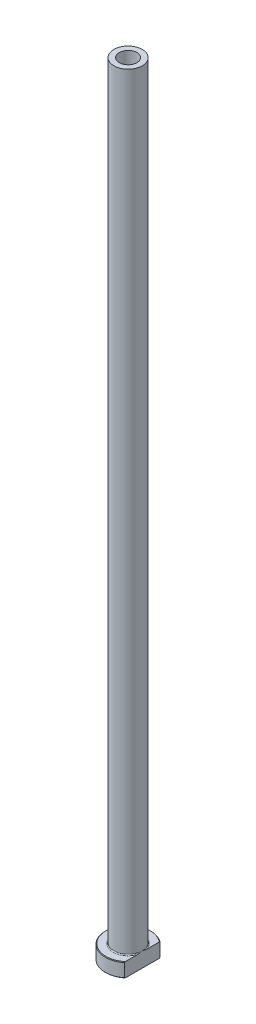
ISO-10303-21;
HEADER;
FILE_DESCRIPTION(('STEP AP214'),'2;1');
FILE_NAME('part.step','',(''),(''),'','','');
FILE_SCHEMA(('AUTOMOTIVE_DESIGN { 1 0 10303 214 1 1 1 1 }'));
ENDSEC;
DATA;
#1=APPLICATION_CONTEXT('core data for automotive mechanical design processes');
#2=APPLICATION_PROTOCOL_DEFINITION('international standard','automotive_design',2000,#1);
#3=PRODUCT_CONTEXT('',#1,'mechanical');
#4=PRODUCT('Part','Part','',(#3));
#5=PRODUCT_RELATED_PRODUCT_CATEGORY('part','',(#4));
#6=PRODUCT_DEFINITION_FORMATION('','',#4);
#7=PRODUCT_DEFINITION_CONTEXT('part definition',#1,'design');
#8=PRODUCT_DEFINITION('design','',#6,#7);
#9=PRODUCT_DEFINITION_SHAPE('','',#8);
#10=(LENGTH_UNIT() NAMED_UNIT(*) SI_UNIT(.MILLI.,.METRE.));
#11=(NAMED_UNIT(*) PLANE_ANGLE_UNIT() SI_UNIT($,.RADIAN.));
#12=(NAMED_UNIT(*) SI_UNIT($,.STERADIAN.) SOLID_ANGLE_UNIT());
#13=UNCERTAINTY_MEASURE_WITH_UNIT(LENGTH_MEASURE(1.E-05),#10,'distance_accuracy_value','');
#14=(GEOMETRIC_REPRESENTATION_CONTEXT(3) GLOBAL_UNCERTAINTY_ASSIGNED_CONTEXT((#13)) GLOBAL_UNIT_ASSIGNED_CONTEXT((#10,
#11,#12)) REPRESENTATION_CONTEXT('',''));
#15=CARTESIAN_POINT('',(0.,0.,0.));
#16=DIRECTION('',(0.,0.,1.));
#17=DIRECTION('',(1.,0.,0.));
#18=AXIS2_PLACEMENT_3D('',#15,#16,#17);
#19=CARTESIAN_POINT('',(0.,92.1876809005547,0.));
#20=DIRECTION('',(0.,1.,0.));
#21=DIRECTION('',(0.,0.,1.));
#22=AXIS2_PLACEMENT_3D('',#19,#20,#21);
#23=CYLINDRICAL_SURFACE('',#22,3.10000000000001);
#24=CARTESIAN_POINT('',(0.,275.,0.));
#25=DIRECTION('',(0.,1.,0.));
#26=DIRECTION('',(0.,0.,1.));
#27=AXIS2_PLACEMENT_3D('',#24,#25,#26);
#28=CIRCLE('',#27,3.10000000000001);
#29=CARTESIAN_POINT('',(0.,275.,3.10000000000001));
#30=VERTEX_POINT('',#29);
#31=EDGE_CURVE('E167',#30,#30,#28,.T.);
#32=ORIENTED_EDGE('',*,*,#31,.T.);
#33=EDGE_LOOP('',(#32));
#34=FACE_BOUND('',#33,.T.);
#35=CARTESIAN_POINT('',(0.,230.,0.));
#36=DIRECTION('',(0.,1.,0.));
#37=DIRECTION('',(0.,0.,1.));
#38=AXIS2_PLACEMENT_3D('',#35,#36,#37);
#39=CIRCLE('',#38,3.10000000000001);
#40=CARTESIAN_POINT('',(0.,230.,3.10000000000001));
#41=VERTEX_POINT('',#40);
#42=EDGE_CURVE('E170',#41,#41,#39,.T.);
#43=ORIENTED_EDGE('',*,*,#42,.F.);
#44=EDGE_LOOP('',(#43));
#45=FACE_BOUND('',#44,.T.);
#46=ADVANCED_FACE('F32',(#34,#45),#23,.F.);
#47=CARTESIAN_POINT('',(-3.10000000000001,275.,0.));
#48=DIRECTION('',(0.,1.,0.));
#49=DIRECTION('',(0.,0.,1.));
#50=AXIS2_PLACEMENT_3D('',#47,#48,#49);
#51=PLANE('',#50);
#52=CARTESIAN_POINT('',(0.,275.,0.));
#53=DIRECTION('',(0.,1.,0.));
#54=DIRECTION('',(0.,0.,1.));
#55=AXIS2_PLACEMENT_3D('',#52,#53,#54);
#56=CIRCLE('',#55,5.00000000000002);
#57=CARTESIAN_POINT('',(0.,275.,5.00000000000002));
#58=VERTEX_POINT('',#57);
#59=EDGE_CURVE('E174',#58,#58,#56,.T.);
#60=ORIENTED_EDGE('',*,*,#59,.T.);
#61=EDGE_LOOP('',(#60));
#62=FACE_BOUND('',#61,.T.);
#63=ORIENTED_EDGE('',*,*,#31,.F.);
#64=EDGE_LOOP('',(#63));
#65=FACE_BOUND('',#64,.T.);
#66=ADVANCED_FACE('F157',(#62,#65),#51,.T.);
#67=CARTESIAN_POINT('',(0.,92.1876809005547,0.));
#68=DIRECTION('',(0.,1.,0.));
#69=DIRECTION('',(0.,0.,1.));
#70=AXIS2_PLACEMENT_3D('',#67,#68,#69);
#71=CYLINDRICAL_SURFACE('',#70,5.00000000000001);
#72=CARTESIAN_POINT('',(0.,5.3,0.));
#73=DIRECTION('',(0.,1.,0.));
#74=DIRECTION('',(0.,0.,1.));
#75=AXIS2_PLACEMENT_3D('',#72,#73,#74);
#76=CIRCLE('',#75,5.00000000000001);
#77=CARTESIAN_POINT('',(5.,5.3,0.));
#78=VERTEX_POINT('',#77);
#79=EDGE_CURVE('E180',#78,#78,#76,.T.);
#80=ORIENTED_EDGE('',*,*,#79,.T.);
#81=EDGE_LOOP('',(#80));
#82=FACE_BOUND('',#81,.T.);
#83=ORIENTED_EDGE('',*,*,#59,.F.);
#84=EDGE_LOOP('',(#83));
#85=FACE_BOUND('',#84,.T.);
#86=ADVANCED_FACE('F162',(#82,#85),#71,.T.);
#87=CARTESIAN_POINT('',(-4.99999999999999,5.,0.));
#88=DIRECTION('',(0.,1.,0.));
#89=DIRECTION('',(0.,0.,1.));
#90=AXIS2_PLACEMENT_3D('',#87,#88,#89);
#91=PLANE('',#90);
#92=DIRECTION('',(0.,0.,1.));
#93=VECTOR('',#92,1.);
#94=CARTESIAN_POINT('',(5.,5.,0.));
#95=LINE('',#94,#93);
#96=CARTESIAN_POINT('',(5.,5.,-5.98665181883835));
#97=VERTEX_POINT('',#96);
#98=CARTESIAN_POINT('',(5.,5.,-1.75783958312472));
#99=VERTEX_POINT('',#98);
#100=EDGE_CURVE('E54',#97,#99,#95,.T.);
#101=ORIENTED_EDGE('',*,*,#100,.F.);
#102=CARTESIAN_POINT('',(0.,5.,0.));
#103=DIRECTION('',(0.,1.,0.));
#104=DIRECTION('',(0.,0.,1.));
#105=AXIS2_PLACEMENT_3D('',#102,#103,#104);
#106=CIRCLE('',#105,7.80000000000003);
#107=CARTESIAN_POINT('',(4.99999999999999,5.,5.98665181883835));
#108=VERTEX_POINT('',#107);
#109=EDGE_CURVE('E186',#97,#108,#106,.T.);
#110=ORIENTED_EDGE('',*,*,#109,.T.);
#111=CARTESIAN_POINT('',(5.,5.,1.75783958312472));
#112=VERTEX_POINT('',#111);
#113=EDGE_CURVE('E134',#112,#108,#95,.T.);
#114=ORIENTED_EDGE('',*,*,#113,.F.);
#115=CARTESIAN_POINT('',(0.,5.,0.));
#116=DIRECTION('',(0.,1.,0.));
#117=DIRECTION('',(0.,0.,1.));
#118=AXIS2_PLACEMENT_3D('',#115,#116,#117);
#119=CIRCLE('',#118,5.30000000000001);
#120=EDGE_CURVE('E183',#112,#99,#119,.F.);
#121=ORIENTED_EDGE('',*,*,#120,.T.);
#122=EDGE_LOOP('',(#101,#110,#114,#121));
#123=FACE_BOUND('',#122,.T.);
#124=ADVANCED_FACE('F197',(#123),#91,.T.);
#125=CARTESIAN_POINT('',(0.,92.1876809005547,0.));
#126=DIRECTION('',(0.,1.,0.));
#127=DIRECTION('',(0.,0.,1.));
#128=AXIS2_PLACEMENT_3D('',#125,#126,#127);
#129=CYLINDRICAL_SURFACE('',#128,7.99999999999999);
#130=DIRECTION('',(0.,-1.,0.));
#131=VECTOR('',#130,1.);
#132=CARTESIAN_POINT('',(4.99999999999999,275.,6.24499799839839));
#133=LINE('',#132,#131);
#134=CARTESIAN_POINT('',(4.99999999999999,4.80000000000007,6.24499799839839));
#135=VERTEX_POINT('',#134);
#136=CARTESIAN_POINT('',(4.99999999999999,0.200000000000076,6.24499799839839));
#137=VERTEX_POINT('',#136);
#138=EDGE_CURVE('E82',#135,#137,#133,.T.);
#139=ORIENTED_EDGE('',*,*,#138,.F.);
#140=CARTESIAN_POINT('',(0.,4.80000000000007,0.));
#141=DIRECTION('',(0.,1.,0.));
#142=DIRECTION('',(0.,0.,1.));
#143=AXIS2_PLACEMENT_3D('',#140,#141,#142);
#144=CIRCLE('',#143,7.99999999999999);
#145=CARTESIAN_POINT('',(5.,4.80000000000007,-6.24499799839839));
#146=VERTEX_POINT('',#145);
#147=EDGE_CURVE('E95',#135,#146,#144,.F.);
#148=ORIENTED_EDGE('',*,*,#147,.T.);
#149=DIRECTION('',(0.,-1.,0.));
#150=VECTOR('',#149,1.);
#151=CARTESIAN_POINT('',(5.,275.,-6.24499799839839));
#152=LINE('',#151,#150);
#153=CARTESIAN_POINT('',(5.,0.200000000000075,-6.24499799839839));
#154=VERTEX_POINT('',#153);
#155=EDGE_CURVE('E192',#146,#154,#152,.T.);
#156=ORIENTED_EDGE('',*,*,#155,.T.);
#157=CARTESIAN_POINT('',(0.,0.200000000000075,0.));
#158=DIRECTION('',(0.,-1.,0.));
#159=DIRECTION('',(0.,0.,-1.));
#160=AXIS2_PLACEMENT_3D('',#157,#158,#159);
#161=CIRCLE('',#160,7.99999999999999);
#162=EDGE_CURVE('E98',#154,#137,#161,.F.);
#163=ORIENTED_EDGE('',*,*,#162,.T.);
#164=EDGE_LOOP('',(#139,#148,#156,#163));
#165=FACE_BOUND('',#164,.T.);
#166=ADVANCED_FACE('F190',(#165),#129,.T.);
#167=CARTESIAN_POINT('',(-7.99999999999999,0.,0.));
#168=DIRECTION('',(0.,-1.,0.));
#169=DIRECTION('',(0.,0.,-1.));
#170=AXIS2_PLACEMENT_3D('',#167,#168,#169);
#171=PLANE('',#170);
#172=CARTESIAN_POINT('',(0.,0.,0.));
#173=DIRECTION('',(0.,-1.,0.));
#174=DIRECTION('',(0.,0.,-1.));
#175=AXIS2_PLACEMENT_3D('',#172,#173,#174);
#176=CIRCLE('',#175,3.84999999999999);
#177=CARTESIAN_POINT('',(0.,0.,-3.84999999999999));
#178=VERTEX_POINT('',#177);
#179=EDGE_CURVE('E40',#178,#178,#176,.F.);
#180=ORIENTED_EDGE('',*,*,#179,.T.);
#181=EDGE_LOOP('',(#180));
#182=FACE_BOUND('',#181,.T.);
#183=DIRECTION('',(0.,0.,-1.));
#184=VECTOR('',#183,1.);
#185=CARTESIAN_POINT('',(4.99999999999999,0.,6.24499799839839));
#186=LINE('',#185,#184);
#187=CARTESIAN_POINT('',(4.99999999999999,0.,5.98665181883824));
#188=VERTEX_POINT('',#187);
#189=CARTESIAN_POINT('',(5.,0.,-5.98665181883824));
#190=VERTEX_POINT('',#189);
#191=EDGE_CURVE('E47',#188,#190,#186,.T.);
#192=ORIENTED_EDGE('',*,*,#191,.F.);
#193=CARTESIAN_POINT('',(0.,0.,0.));
#194=DIRECTION('',(0.,-1.,0.));
#195=DIRECTION('',(0.,0.,-1.));
#196=AXIS2_PLACEMENT_3D('',#193,#194,#195);
#197=CIRCLE('',#196,7.79999999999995);
#198=EDGE_CURVE('E92',#188,#190,#197,.T.);
#199=ORIENTED_EDGE('',*,*,#198,.T.);
#200=EDGE_LOOP('',(#192,#199));
#201=FACE_BOUND('',#200,.T.);
#202=ADVANCED_FACE('F91',(#182,#201),#171,.T.);
#203=CARTESIAN_POINT('',(0.,92.1876809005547,0.));
#204=DIRECTION('',(0.,1.,0.));
#205=DIRECTION('',(0.,0.,1.));
#206=AXIS2_PLACEMENT_3D('',#203,#204,#205);
#207=CYLINDRICAL_SURFACE('',#206,3.35);
#208=CARTESIAN_POINT('',(0.,0.5,0.));
#209=DIRECTION('',(0.,-1.,0.));
#210=DIRECTION('',(0.,0.,-1.));
#211=AXIS2_PLACEMENT_3D('',#208,#209,#210);
#212=CIRCLE('',#211,3.35);
#213=CARTESIAN_POINT('',(0.,0.5,-3.35));
#214=VERTEX_POINT('',#213);
#215=EDGE_CURVE('E11',#214,#214,#212,.T.);
#216=ORIENTED_EDGE('',*,*,#215,.T.);
#217=EDGE_LOOP('',(#216));
#218=FACE_BOUND('',#217,.T.);
#219=CARTESIAN_POINT('',(0.,218.,0.));
#220=DIRECTION('',(0.,1.,0.));
#221=DIRECTION('',(0.,0.,1.));
#222=AXIS2_PLACEMENT_3D('',#219,#220,#221);
#223=CIRCLE('',#222,3.35000000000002);
#224=CARTESIAN_POINT('',(0.,218.,3.35000000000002));
#225=VERTEX_POINT('',#224);
#226=EDGE_CURVE('E172',#225,#225,#223,.T.);
#227=ORIENTED_EDGE('',*,*,#226,.T.);
#228=EDGE_LOOP('',(#227));
#229=FACE_BOUND('',#228,.T.);
#230=ADVANCED_FACE('F215',(#218,#229),#207,.F.);
#231=CARTESIAN_POINT('',(0.,218.,0.));
#232=DIRECTION('',(0.,-1.,0.));
#233=DIRECTION('',(0.,0.,-1.));
#234=AXIS2_PLACEMENT_3D('',#231,#232,#233);
#235=CONICAL_SURFACE('',#234,3.35000000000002,0.0208303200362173);
#236=ORIENTED_EDGE('',*,*,#42,.T.);
#237=EDGE_LOOP('',(#236));
#238=FACE_BOUND('',#237,.T.);
#239=ORIENTED_EDGE('',*,*,#226,.F.);
#240=EDGE_LOOP('',(#239));
#241=FACE_BOUND('',#240,.T.);
#242=ADVANCED_FACE('F111',(#238,#241),#235,.F.);
#243=CARTESIAN_POINT('',(0.,5.3,0.));
#244=DIRECTION('',(0.,1.,0.));
#245=DIRECTION('',(0.,0.,1.));
#246=AXIS2_PLACEMENT_3D('',#243,#244,#245);
#247=TOROIDAL_SURFACE('',#246,5.30000000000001,0.3);
#248=ORIENTED_EDGE('',*,*,#120,.F.);
#249=CARTESIAN_POINT('',(5.,5.3,0.));
#250=CARTESIAN_POINT('',(5.,5.30000062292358,-1.31469178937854E-10));
#251=CARTESIAN_POINT('',(5.,5.30000124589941,2.52759407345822E-07));
#252=CARTESIAN_POINT('',(5.,5.30000240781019,9.47164733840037E-07));
#253=CARTESIAN_POINT('',(5.,5.30000293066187,1.40594081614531E-06));
#254=CARTESIAN_POINT('',(5.,5.30000402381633,2.50637668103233E-06));
#255=CARTESIAN_POINT('',(5.,5.30000457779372,3.16588983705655E-06));
#256=CARTESIAN_POINT('',(5.,5.30000556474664,4.52860049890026E-06));
#257=CARTESIAN_POINT('',(5.,5.30000600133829,5.22939526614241E-06));
#258=CARTESIAN_POINT('',(5.,5.30000763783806,7.96122117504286E-06));
#259=CARTESIAN_POINT('',(5.,5.30000875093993,1.00477426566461E-05));
#260=CARTESIAN_POINT('',(5.,5.30001056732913,1.41660893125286E-05));
#261=CARTESIAN_POINT('',(5.,5.3000112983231,1.61861800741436E-05));
#262=CARTESIAN_POINT('',(5.,5.30001439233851,2.47865769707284E-05));
#263=CARTESIAN_POINT('',(5.,5.30001672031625,3.13830323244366E-05));
#264=CARTESIAN_POINT('',(5.,5.3000201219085,4.38084266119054E-05));
#265=CARTESIAN_POINT('',(5.,5.30002133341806,4.95992779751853E-05));
#266=CARTESIAN_POINT('',(4.99999999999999,5.30003020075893,9.27862676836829E-05));
#267=CARTESIAN_POINT('',(5.,5.30003696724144,0.000130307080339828));
#268=CARTESIAN_POINT('',(5.,5.30006659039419,0.000278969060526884));
#269=CARTESIAN_POINT('',(5.,5.30009481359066,0.00038902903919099));
#270=CARTESIAN_POINT('',(4.99999999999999,5.30020506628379,0.000826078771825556));
#271=CARTESIAN_POINT('',(5.,5.30028365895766,0.00115365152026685));
#272=CARTESIAN_POINT('',(5.,5.30059919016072,0.00245925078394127));
#273=CARTESIAN_POINT('',(5.,5.30084048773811,0.00343651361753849));
#274=CARTESIAN_POINT('',(4.99999999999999,5.30184626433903,0.00752058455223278));
#275=CARTESIAN_POINT('',(4.99999999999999,5.30260525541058,0.0106283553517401));
#276=CARTESIAN_POINT('',(5.,5.30996461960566,0.0407482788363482));
#277=CARTESIAN_POINT('',(5.,5.3165898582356,0.0677561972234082));
#278=CARTESIAN_POINT('',(4.99999999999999,5.32953319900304,0.120688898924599));
#279=CARTESIAN_POINT('',(4.99999999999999,5.33585289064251,0.146613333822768));
#280=CARTESIAN_POINT('',(5.,5.34926050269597,0.20179565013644));
#281=CARTESIAN_POINT('',(5.,5.35634306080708,0.231054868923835));
#282=CARTESIAN_POINT('',(5.,5.3705025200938,0.289917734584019));
#283=CARTESIAN_POINT('',(5.,5.37757848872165,0.319521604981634));
#284=CARTESIAN_POINT('',(5.,5.3945260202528,0.391032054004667));
#285=CARTESIAN_POINT('',(5.,5.4043407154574,0.432952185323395));
#286=CARTESIAN_POINT('',(5.,5.42340141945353,0.515763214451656));
#287=CARTESIAN_POINT('',(5.,5.43265559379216,0.556652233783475));
#288=CARTESIAN_POINT('',(5.,5.4571055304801,0.66707517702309));
#289=CARTESIAN_POINT('',(5.,5.47194176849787,0.736689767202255));
#290=CARTESIAN_POINT('',(5.,5.50018229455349,0.876836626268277));
#291=CARTESIAN_POINT('',(5.,5.51357312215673,0.947371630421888));
#292=CARTESIAN_POINT('',(5.,5.53930921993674,1.09497328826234));
#293=CARTESIAN_POINT('',(5.,5.55146217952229,1.17207432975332));
#294=CARTESIAN_POINT('',(5.,5.57239669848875,1.32672649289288));
#295=CARTESIAN_POINT('',(5.,5.58117877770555,1.40427754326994));
#296=CARTESIAN_POINT('',(5.,5.59499725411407,1.56873827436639));
#297=CARTESIAN_POINT('',(5.,5.59948802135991,1.65570044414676));
#298=CARTESIAN_POINT('',(5.,5.60018885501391,1.78535304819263));
#299=CARTESIAN_POINT('',(5.,5.59945214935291,1.8280257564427));
#300=CARTESIAN_POINT('',(5.,5.59559364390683,1.91325081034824));
#301=CARTESIAN_POINT('',(5.,5.59247319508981,1.95580321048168));
#302=CARTESIAN_POINT('',(5.,5.58383242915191,2.03512365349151));
#303=CARTESIAN_POINT('',(5.,5.5786738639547,2.07192937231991));
#304=CARTESIAN_POINT('',(5.,5.56543793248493,2.1452675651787));
#305=CARTESIAN_POINT('',(5.,5.55734203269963,2.18179676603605));
#306=CARTESIAN_POINT('',(5.,5.53718005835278,2.25427226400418));
#307=CARTESIAN_POINT('',(5.,5.52507057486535,2.29020746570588));
#308=CARTESIAN_POINT('',(5.,5.50270928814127,2.34223029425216));
#309=CARTESIAN_POINT('',(5.,5.49457811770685,2.3592231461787));
#310=CARTESIAN_POINT('',(5.,5.47657809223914,2.39224900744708));
#311=CARTESIAN_POINT('',(5.,5.4667128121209,2.40828390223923));
#312=CARTESIAN_POINT('',(5.,5.44695893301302,2.43579467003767));
#313=CARTESIAN_POINT('',(5.,5.43745879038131,2.44754592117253));
#314=CARTESIAN_POINT('',(5.,5.41677914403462,2.46946476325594));
#315=CARTESIAN_POINT('',(5.,5.40560543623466,2.47963758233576));
#316=CARTESIAN_POINT('',(5.,5.38617750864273,2.49393642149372));
#317=CARTESIAN_POINT('',(5.,5.37851643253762,2.49886271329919));
#318=CARTESIAN_POINT('',(5.,5.36252740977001,2.5074995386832));
#319=CARTESIAN_POINT('',(5.,5.35419984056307,2.51121075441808));
#320=CARTESIAN_POINT('',(5.,5.33690648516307,2.51712941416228));
#321=CARTESIAN_POINT('',(5.,5.32793451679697,2.51931927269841));
#322=CARTESIAN_POINT('',(5.,5.3097357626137,2.52185978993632));
#323=CARTESIAN_POINT('',(5.,5.30050931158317,2.52221275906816));
#324=CARTESIAN_POINT('',(5.,5.28349166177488,2.52112455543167));
#325=CARTESIAN_POINT('',(5.,5.27568322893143,2.51993178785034));
#326=CARTESIAN_POINT('',(5.,5.2603686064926,2.51628294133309));
#327=CARTESIAN_POINT('',(5.,5.25286261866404,2.51382603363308));
#328=CARTESIAN_POINT('',(5.,5.23590266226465,2.50685484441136));
#329=CARTESIAN_POINT('',(5.,5.22661875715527,2.50192984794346));
#330=CARTESIAN_POINT('',(5.,5.20895514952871,2.49066548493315));
#331=CARTESIAN_POINT('',(5.,5.20057756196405,2.48432291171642));
#332=CARTESIAN_POINT('',(5.,5.17987008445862,2.46645212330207));
#333=CARTESIAN_POINT('',(5.,5.16824151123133,2.45411867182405));
#334=CARTESIAN_POINT('',(5.,5.14692461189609,2.42790849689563));
#335=CARTESIAN_POINT('',(5.,5.13723987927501,2.41402898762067));
#336=CARTESIAN_POINT('',(5.,5.11080706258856,2.37143175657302));
#337=CARTESIAN_POINT('',(5.,5.09628770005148,2.34134703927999));
#338=CARTESIAN_POINT('',(5.,5.07130349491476,2.2794073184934));
#339=CARTESIAN_POINT('',(5.,5.06087110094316,2.24754035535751));
#340=CARTESIAN_POINT('',(5.,5.03890359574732,2.16787245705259));
#341=CARTESIAN_POINT('',(5.,5.02913523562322,2.11959065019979));
#342=CARTESIAN_POINT('',(5.,5.01416953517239,2.02224928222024));
#343=CARTESIAN_POINT('',(5.,5.0089863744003,1.97318778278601));
#344=CARTESIAN_POINT('',(5.,5.00220823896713,1.87635767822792));
#345=CARTESIAN_POINT('',(5.,5.00050709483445,1.82859609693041));
#346=CARTESIAN_POINT('',(5.,4.99969104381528,1.73330165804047));
#347=CARTESIAN_POINT('',(5.,5.00056327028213,1.68576884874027));
#348=CARTESIAN_POINT('',(5.,5.00484296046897,1.57937770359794));
#349=CARTESIAN_POINT('',(5.,5.00880932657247,1.52054285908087));
#350=CARTESIAN_POINT('',(5.,5.01925964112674,1.40312974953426));
#351=CARTESIAN_POINT('',(5.,5.0257426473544,1.34455139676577));
#352=CARTESIAN_POINT('',(5.,5.04090087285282,1.22627662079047));
#353=CARTESIAN_POINT('',(5.,5.0496242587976,1.16658647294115));
#354=CARTESIAN_POINT('',(5.,5.06877923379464,1.04732463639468));
#355=CARTESIAN_POINT('',(5.,5.07921523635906,0.987753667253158));
#356=CARTESIAN_POINT('',(5.,5.10551698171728,0.846936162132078));
#357=CARTESIAN_POINT('',(4.99999999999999,5.12196565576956,0.765799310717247));
#358=CARTESIAN_POINT('',(5.,5.15639716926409,0.604819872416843));
#359=CARTESIAN_POINT('',(5.,5.17436050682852,0.524973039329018));
#360=CARTESIAN_POINT('',(4.99999999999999,5.20921667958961,0.374726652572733));
#361=CARTESIAN_POINT('',(4.99999999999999,5.2259938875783,0.304300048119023));
#362=CARTESIAN_POINT('',(5.,5.25191105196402,0.196907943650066));
#363=CARTESIAN_POINT('',(5.00000000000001,5.26090146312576,0.159905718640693));
#364=CARTESIAN_POINT('',(4.99999999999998,5.27881854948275,0.0865164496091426));
#365=CARTESIAN_POINT('',(4.99999999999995,5.28774391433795,0.0501291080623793));
#366=CARTESIAN_POINT('',(5.,5.29739627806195,0.010621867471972));
#367=CARTESIAN_POINT('',(5.,5.29815688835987,0.00750762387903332));
#368=CARTESIAN_POINT('',(4.99999999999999,5.29916304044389,0.00342209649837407));
#369=CARTESIAN_POINT('',(4.99999999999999,5.29940309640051,0.00244985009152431));
#370=CARTESIAN_POINT('',(5.,5.29971711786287,0.00115049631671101));
#371=CARTESIAN_POINT('',(5.,5.29979541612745,0.000824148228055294));
#372=CARTESIAN_POINT('',(4.99999999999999,5.29990531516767,0.000388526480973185));
#373=CARTESIAN_POINT('',(4.99999999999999,5.29993348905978,0.00027867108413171));
#374=CARTESIAN_POINT('',(5.,5.2999630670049,0.000130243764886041));
#375=CARTESIAN_POINT('',(5.,5.29996982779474,9.27511442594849E-05));
#376=CARTESIAN_POINT('',(5.,5.29997868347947,4.95929930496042E-05));
#377=CARTESIAN_POINT('',(5.,5.29997989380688,4.38036601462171E-05));
#378=CARTESIAN_POINT('',(5.,5.29998329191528,3.1381422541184E-05));
#379=CARTESIAN_POINT('',(5.,5.29998561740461,2.47865248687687E-05));
#380=CARTESIAN_POINT('',(5.,5.29998870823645,1.61877564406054E-05));
#381=CARTESIAN_POINT('',(5.,5.29998943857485,1.4167778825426E-05));
#382=CARTESIAN_POINT('',(5.,5.29999125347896,1.00495548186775E-05));
#383=CARTESIAN_POINT('',(5.,5.2999923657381,7.96302793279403E-06));
#384=CARTESIAN_POINT('',(5.,5.2999940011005,5.2310749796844E-06));
#385=CARTESIAN_POINT('',(5.,5.29999443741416,4.53021119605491E-06));
#386=CARTESIAN_POINT('',(5.,5.29999542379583,3.16731231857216E-06));
#387=CARTESIAN_POINT('',(5.,5.29999597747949,2.50767789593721E-06));
#388=CARTESIAN_POINT('',(5.,5.29999707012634,1.40695923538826E-06));
#389=CARTESIAN_POINT('',(5.,5.29999759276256,9.48032841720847E-07));
#390=CARTESIAN_POINT('',(5.,5.29999875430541,2.53244516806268E-07));
#391=CARTESIAN_POINT('',(5.,5.29999937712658,1.31459980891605E-10));
#392=CARTESIAN_POINT('',(5.,5.3,0.));
#393=B_SPLINE_CURVE_WITH_KNOTS('',3,(#249,#250,#251,#252,#253,#254,#255,#256,#257,#258,#259,
#260,#261,#262,#263,#264,#265,#266,#267,#268,#269,#270,#271,#272,#273,#274,#275,#276,#277,#278,
#279,#280,#281,#282,#283,#284,#285,#286,#287,#288,#289,#290,#291,#292,#293,#294,#295,#296,#297,
#298,#299,#300,#301,#302,#303,#304,#305,#306,#307,#308,#309,#310,#311,#312,#313,#314,#315,#316,
#317,#318,#319,#320,#321,#322,#323,#324,#325,#326,#327,#328,#329,#330,#331,#332,#333,#334,#335,
#336,#337,#338,#339,#340,#341,#342,#343,#344,#345,#346,#347,#348,#349,#350,#351,#352,#353,#354,
#355,#356,#357,#358,#359,#360,#361,#362,#363,#364,#365,#366,#367,#368,#369,#370,#371,#372,#373,
#374,#375,#376,#377,#378,#379,#380,#381,#382,#383,#384,#385,#386,#387,#388,#389,#390,#391,#392),
.UNSPECIFIED.,.T.,.F.,(4,2,2,2,2,2,2,2,2,2,2,2,2,2,2,2,2,2,2,2,2,2,2,2,2,2,2,2,2,2,2,2,2,2,2,2,
2,2,2,2,2,2,2,2,2,2,2,2,2,2,2,2,2,2,2,2,2,2,2,2,2,2,2,2,2,2,2,2,2,2,2,4),(0.,
1.88939082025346E-06,3.98058498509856E-06,6.54818035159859E-06,9.02403721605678E-06,
1.60938675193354E-05,2.25328102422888E-05,4.34843831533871E-05,6.12120081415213E-05,
0.000175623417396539,0.000516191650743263,0.00152710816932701,0.00454656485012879,
0.0141443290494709,0.097567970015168,0.177619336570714,0.267931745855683,0.359245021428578,
0.488405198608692,0.614173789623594,0.827694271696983,1.0430571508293,1.27715608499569,
1.51121890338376,1.77214751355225,1.90013509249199,2.02805018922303,2.13945459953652,
2.25157451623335,2.3649489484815,2.42139235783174,2.47772074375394,2.5229380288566,
2.56800219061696,2.59524342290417,2.62246933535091,2.65000494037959,2.67750590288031,
2.70108948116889,2.72468854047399,2.75603978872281,2.78746268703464,2.83802806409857,
2.88868607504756,2.98834295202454,3.08877575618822,3.23618650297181,3.38405153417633,
3.52733651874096,3.66990630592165,3.8467390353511,4.02350562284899,4.20444776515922,
4.38586374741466,4.6341955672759,4.87971270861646,5.09690175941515,5.21113882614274,
5.3235336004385,5.33315137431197,5.33615533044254,5.33716246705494,5.33750240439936,
5.33761672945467,5.33763445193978,5.33765539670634,5.33766183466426,5.33766890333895,
5.33767137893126,5.33767394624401,5.33767603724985,5.33767792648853),.UNSPECIFIED.);
#394=EDGE_CURVE('E126',#112,#78,#393,.T.);
#395=ORIENTED_EDGE('',*,*,#394,.T.);
#396=ORIENTED_EDGE('',*,*,#79,.F.);
#397=CARTESIAN_POINT('',(5.,5.3,0.));
#398=CARTESIAN_POINT('',(5.,5.29999937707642,1.31470519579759E-10));
#399=CARTESIAN_POINT('',(5.,5.29999875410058,-2.52759405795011E-07));
#400=CARTESIAN_POINT('',(5.,5.29999759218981,-9.47164732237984E-07));
#401=CARTESIAN_POINT('',(5.,5.29999706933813,-1.40594081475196E-06));
#402=CARTESIAN_POINT('',(5.,5.29999597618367,-2.5063766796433E-06));
#403=CARTESIAN_POINT('',(5.,5.29999542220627,-3.16588983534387E-06));
#404=CARTESIAN_POINT('',(5.,5.29999443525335,-4.52860049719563E-06));
#405=CARTESIAN_POINT('',(5.,5.29999399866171,-5.22939526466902E-06));
#406=CARTESIAN_POINT('',(5.,5.29999236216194,-7.96122117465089E-06));
#407=CARTESIAN_POINT('',(5.,5.29999124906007,-1.00477426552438E-05));
#408=CARTESIAN_POINT('',(5.,5.29998943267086,-1.41660893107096E-05));
#409=CARTESIAN_POINT('',(5.,5.2999887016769,-1.61861800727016E-05));
#410=CARTESIAN_POINT('',(5.,5.29998560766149,-2.47865769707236E-05));
#411=CARTESIAN_POINT('',(5.,5.29998327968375,-3.13830323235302E-05));
#412=CARTESIAN_POINT('',(5.,5.2999798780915,-4.38084266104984E-05));
#413=CARTESIAN_POINT('',(5.,5.29997866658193,-4.9599277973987E-05));
#414=CARTESIAN_POINT('',(4.99999999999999,5.29996979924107,-9.27862676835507E-05));
#415=CARTESIAN_POINT('',(5.,5.29996303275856,-0.000130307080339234));
#416=CARTESIAN_POINT('',(5.,5.29993340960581,-0.000278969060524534));
#417=CARTESIAN_POINT('',(5.,5.29990518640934,-0.000389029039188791));
#418=CARTESIAN_POINT('',(4.99999999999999,5.29979493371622,-0.000826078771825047));
#419=CARTESIAN_POINT('',(5.,5.29971634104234,-0.00115365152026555));
#420=CARTESIAN_POINT('',(5.,5.29940080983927,-0.00245925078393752));
#421=CARTESIAN_POINT('',(5.,5.29915951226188,-0.00343651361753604));
#422=CARTESIAN_POINT('',(4.99999999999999,5.29815373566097,-0.00752058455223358));
#423=CARTESIAN_POINT('',(4.99999999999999,5.29739474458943,-0.0106283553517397));
#424=CARTESIAN_POINT('',(5.,5.29003538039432,-0.040748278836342));
#425=CARTESIAN_POINT('',(5.,5.28341014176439,-0.0677561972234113));
#426=CARTESIAN_POINT('',(4.99999999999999,5.27046680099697,-0.120688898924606));
#427=CARTESIAN_POINT('',(4.99999999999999,5.26414710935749,-0.146613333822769));
#428=CARTESIAN_POINT('',(5.,5.25073949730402,-0.201795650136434));
#429=CARTESIAN_POINT('',(5.,5.24365693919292,-0.231054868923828));
#430=CARTESIAN_POINT('',(5.,5.2294974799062,-0.289917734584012));
#431=CARTESIAN_POINT('',(5.,5.22242151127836,-0.319521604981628));
#432=CARTESIAN_POINT('',(5.,5.2054739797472,-0.391032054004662));
#433=CARTESIAN_POINT('',(5.,5.19565928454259,-0.432952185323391));
#434=CARTESIAN_POINT('',(5.,5.17659858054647,-0.515763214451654));
#435=CARTESIAN_POINT('',(5.,5.16734440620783,-0.556652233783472));
#436=CARTESIAN_POINT('',(5.,5.1428944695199,-0.667075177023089));
#437=CARTESIAN_POINT('',(5.,5.12805823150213,-0.736689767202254));
#438=CARTESIAN_POINT('',(5.,5.09981770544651,-0.876836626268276));
#439=CARTESIAN_POINT('',(5.,5.08642687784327,-0.947371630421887));
#440=CARTESIAN_POINT('',(5.,5.06069078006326,-1.09497328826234));
#441=CARTESIAN_POINT('',(5.,5.04853782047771,-1.17207432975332));
#442=CARTESIAN_POINT('',(5.,5.02760330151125,-1.32672649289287));
#443=CARTESIAN_POINT('',(5.,5.01882122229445,-1.40427754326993));
#444=CARTESIAN_POINT('',(5.,5.00500274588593,-1.56873827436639));
#445=CARTESIAN_POINT('',(5.,5.00051197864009,-1.65570044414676));
#446=CARTESIAN_POINT('',(5.,4.99981114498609,-1.78535304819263));
#447=CARTESIAN_POINT('',(5.,5.00054785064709,-1.82802575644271));
#448=CARTESIAN_POINT('',(5.,5.00440635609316,-1.91325081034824));
#449=CARTESIAN_POINT('',(5.,5.00752680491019,-1.95580321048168));
#450=CARTESIAN_POINT('',(5.,5.01616757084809,-2.03512365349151));
#451=CARTESIAN_POINT('',(5.,5.0213261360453,-2.07192937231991));
#452=CARTESIAN_POINT('',(5.,5.03456206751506,-2.14526756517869));
#453=CARTESIAN_POINT('',(5.,5.04265796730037,-2.18179676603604));
#454=CARTESIAN_POINT('',(5.,5.06281994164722,-2.25427226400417));
#455=CARTESIAN_POINT('',(5.,5.07492942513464,-2.29020746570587));
#456=CARTESIAN_POINT('',(5.,5.09729071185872,-2.34223029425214));
#457=CARTESIAN_POINT('',(5.,5.10542188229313,-2.35922314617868));
#458=CARTESIAN_POINT('',(5.,5.12342190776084,-2.39224900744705));
#459=CARTESIAN_POINT('',(5.,5.13328718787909,-2.4082839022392));
#460=CARTESIAN_POINT('',(5.,5.15304106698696,-2.43579467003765));
#461=CARTESIAN_POINT('',(5.,5.16254120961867,-2.44754592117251));
#462=CARTESIAN_POINT('',(5.,5.18322085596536,-2.46946476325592));
#463=CARTESIAN_POINT('',(5.,5.19439456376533,-2.47963758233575));
#464=CARTESIAN_POINT('',(5.,5.21382249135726,-2.49393642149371));
#465=CARTESIAN_POINT('',(5.,5.22148356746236,-2.49886271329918));
#466=CARTESIAN_POINT('',(5.,5.23747259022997,-2.50749953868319));
#467=CARTESIAN_POINT('',(5.,5.24580015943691,-2.51121075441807));
#468=CARTESIAN_POINT('',(5.,5.26309351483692,-2.51712941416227));
#469=CARTESIAN_POINT('',(5.,5.27206548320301,-2.5193192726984));
#470=CARTESIAN_POINT('',(5.,5.29026423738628,-2.52185978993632));
#471=CARTESIAN_POINT('',(5.,5.29949068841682,-2.52221275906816));
#472=CARTESIAN_POINT('',(5.,5.31650833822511,-2.52112455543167));
#473=CARTESIAN_POINT('',(5.,5.32431677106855,-2.51993178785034));
#474=CARTESIAN_POINT('',(5.,5.33963139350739,-2.51628294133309));
#475=CARTESIAN_POINT('',(5.,5.34713738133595,-2.51382603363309));
#476=CARTESIAN_POINT('',(5.,5.36409733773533,-2.50685484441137));
#477=CARTESIAN_POINT('',(5.,5.37338124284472,-2.50192984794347));
#478=CARTESIAN_POINT('',(5.,5.39104485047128,-2.49066548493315));
#479=CARTESIAN_POINT('',(5.,5.39942243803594,-2.48432291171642));
#480=CARTESIAN_POINT('',(5.,5.42012991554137,-2.46645212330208));
#481=CARTESIAN_POINT('',(5.,5.43175848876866,-2.45411867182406));
#482=CARTESIAN_POINT('',(5.,5.45307538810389,-2.42790849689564));
#483=CARTESIAN_POINT('',(5.,5.46276012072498,-2.41402898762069));
#484=CARTESIAN_POINT('',(5.,5.48919293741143,-2.37143175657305));
#485=CARTESIAN_POINT('',(5.,5.5037122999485,-2.34134703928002));
#486=CARTESIAN_POINT('',(5.,5.52869650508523,-2.27940731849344));
#487=CARTESIAN_POINT('',(5.,5.53912889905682,-2.24754035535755));
#488=CARTESIAN_POINT('',(5.,5.56109640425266,-2.16787245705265));
#489=CARTESIAN_POINT('',(5.,5.57086476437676,-2.11959065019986));
#490=CARTESIAN_POINT('',(5.,5.5858304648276,-2.02224928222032));
#491=CARTESIAN_POINT('',(5.,5.59101362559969,-1.97318778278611));
#492=CARTESIAN_POINT('',(5.,5.59779176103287,-1.87635767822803));
#493=CARTESIAN_POINT('',(5.,5.59949290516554,-1.82859609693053));
#494=CARTESIAN_POINT('',(5.,5.60030895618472,-1.7333016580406));
#495=CARTESIAN_POINT('',(5.,5.59943672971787,-1.68576884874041));
#496=CARTESIAN_POINT('',(5.,5.59515703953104,-1.57937770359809));
#497=CARTESIAN_POINT('',(5.,5.59119067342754,-1.52054285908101));
#498=CARTESIAN_POINT('',(5.,5.58074035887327,-1.40312974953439));
#499=CARTESIAN_POINT('',(5.,5.57425735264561,-1.34455139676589));
#500=CARTESIAN_POINT('',(5.,5.55909912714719,-1.22627662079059));
#501=CARTESIAN_POINT('',(5.,5.55037574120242,-1.16658647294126));
#502=CARTESIAN_POINT('',(5.,5.53122076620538,-1.04732463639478));
#503=CARTESIAN_POINT('',(5.,5.52078476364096,-0.98775366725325));
#504=CARTESIAN_POINT('',(5.,5.49448301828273,-0.846936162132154));
#505=CARTESIAN_POINT('',(5.,5.47803434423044,-0.765799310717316));
#506=CARTESIAN_POINT('',(5.,5.44360283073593,-0.604819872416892));
#507=CARTESIAN_POINT('',(5.,5.42563949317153,-0.524973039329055));
#508=CARTESIAN_POINT('',(4.99999999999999,5.39078332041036,-0.374726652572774));
#509=CARTESIAN_POINT('',(4.99999999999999,5.37400611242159,-0.304300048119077));
#510=CARTESIAN_POINT('',(5.,5.34808894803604,-0.196907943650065));
#511=CARTESIAN_POINT('',(5.,5.33909853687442,-0.15990571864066));
#512=CARTESIAN_POINT('',(4.99999999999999,5.32118145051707,-0.0865164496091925));
#513=CARTESIAN_POINT('',(4.99999999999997,5.3122560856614,-0.0501291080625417));
#514=CARTESIAN_POINT('',(5.,5.3026037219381,-0.010621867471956));
#515=CARTESIAN_POINT('',(5.,5.30184311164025,-0.00750762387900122));
#516=CARTESIAN_POINT('',(4.99999999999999,5.30083695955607,-0.0034220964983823));
#517=CARTESIAN_POINT('',(4.99999999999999,5.30059690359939,-0.00244985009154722));
#518=CARTESIAN_POINT('',(5.,5.30028288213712,-0.00115049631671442));
#519=CARTESIAN_POINT('',(5.,5.30020458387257,-0.000824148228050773));
#520=CARTESIAN_POINT('',(4.99999999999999,5.30009468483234,-0.000388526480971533));
#521=CARTESIAN_POINT('',(4.99999999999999,5.30006651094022,-0.000278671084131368));
#522=CARTESIAN_POINT('',(5.,5.3000369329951,-0.000130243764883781));
#523=CARTESIAN_POINT('',(5.,5.30003017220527,-9.27511442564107E-05));
#524=CARTESIAN_POINT('',(5.,5.30002131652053,-4.95929930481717E-05));
#525=CARTESIAN_POINT('',(5.,5.30002010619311,-4.38036601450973E-05));
#526=CARTESIAN_POINT('',(5.,5.30001670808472,-3.1381422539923E-05));
#527=CARTESIAN_POINT('',(5.,5.30001438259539,-2.47865248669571E-05));
#528=CARTESIAN_POINT('',(5.,5.30001129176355,-1.61877564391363E-05));
#529=CARTESIAN_POINT('',(5.,5.30001056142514,-1.41677788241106E-05));
#530=CARTESIAN_POINT('',(5.,5.30000874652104,-1.00495548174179E-05));
#531=CARTESIAN_POINT('',(5.,5.30000763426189,-7.96302793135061E-06));
#532=CARTESIAN_POINT('',(5.,5.3000059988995,-5.23107497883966E-06));
#533=CARTESIAN_POINT('',(5.,5.30000556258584,-4.53021119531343E-06));
#534=CARTESIAN_POINT('',(5.,5.30000457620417,-3.16731231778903E-06));
#535=CARTESIAN_POINT('',(5.,5.3000040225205,-2.50767789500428E-06));
#536=CARTESIAN_POINT('',(5.,5.30000292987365,-1.40695923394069E-06));
#537=CARTESIAN_POINT('',(5.,5.30000240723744,-9.48032839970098E-07));
#538=CARTESIAN_POINT('',(5.,5.30000124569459,-2.53244515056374E-07));
#539=CARTESIAN_POINT('',(5.,5.30000062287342,-1.31458543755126E-10));
#540=CARTESIAN_POINT('',(5.,5.3,0.));
#541=B_SPLINE_CURVE_WITH_KNOTS('',3,(#397,#398,#399,#400,#401,#402,#403,#404,#405,#406,#407,
#408,#409,#410,#411,#412,#413,#414,#415,#416,#417,#418,#419,#420,#421,#422,#423,#424,#425,#426,
#427,#428,#429,#430,#431,#432,#433,#434,#435,#436,#437,#438,#439,#440,#441,#442,#443,#444,#445,
#446,#447,#448,#449,#450,#451,#452,#453,#454,#455,#456,#457,#458,#459,#460,#461,#462,#463,#464,
#465,#466,#467,#468,#469,#470,#471,#472,#473,#474,#475,#476,#477,#478,#479,#480,#481,#482,#483,
#484,#485,#486,#487,#488,#489,#490,#491,#492,#493,#494,#495,#496,#497,#498,#499,#500,#501,#502,
#503,#504,#505,#506,#507,#508,#509,#510,#511,#512,#513,#514,#515,#516,#517,#518,#519,#520,#521,
#522,#523,#524,#525,#526,#527,#528,#529,#530,#531,#532,#533,#534,#535,#536,#537,#538,#539,#540),
.UNSPECIFIED.,.T.,.F.,(4,2,2,2,2,2,2,2,2,2,2,2,2,2,2,2,2,2,2,2,2,2,2,2,2,2,2,2,2,2,2,2,2,2,2,2,
2,2,2,2,2,2,2,2,2,2,2,2,2,2,2,2,2,2,2,2,2,2,2,2,2,2,2,2,2,2,2,2,2,2,2,4),(0.,
1.8893908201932E-06,3.98058498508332E-06,6.54818035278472E-06,9.02403721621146E-06,
1.60938675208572E-05,2.25328102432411E-05,4.34843831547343E-05,6.12120081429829E-05,
0.00017562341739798,0.000516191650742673,0.00152710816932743,0.00454656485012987,
0.0141443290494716,0.0975679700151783,0.177619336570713,0.267931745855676,0.359245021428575,
0.48840519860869,0.614173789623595,0.827694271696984,1.04305715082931,1.27715608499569,
1.51121890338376,1.77214751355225,1.900135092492,2.02805018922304,2.13945459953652,
2.25157451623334,2.36494894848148,2.42139235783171,2.47772074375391,2.52293802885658,
2.56800219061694,2.59524342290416,2.6224693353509,2.65000494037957,2.6775059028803,
2.70108948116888,2.72468854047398,2.75603978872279,2.78746268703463,2.83802806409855,
2.88868607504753,2.9883429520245,3.08877575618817,3.23618650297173,3.38405153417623,
3.52733651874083,3.6699063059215,3.84673903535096,4.02350562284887,4.20444776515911,
4.38586374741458,4.63419556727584,4.87971270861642,5.09690175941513,5.21113882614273,
5.3235336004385,5.33315137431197,5.33615533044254,5.33716246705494,5.33750240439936,
5.33761672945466,5.33763445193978,5.33765539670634,5.33766183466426,5.33766890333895,
5.33767137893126,5.33767394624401,5.33767603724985,5.33767792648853),.UNSPECIFIED.);
#542=EDGE_CURVE('E135',#78,#99,#541,.T.);
#543=ORIENTED_EDGE('',*,*,#542,.T.);
#544=EDGE_LOOP('',(#248,#395,#396,#543));
#545=FACE_BOUND('',#544,.T.);
#546=ADVANCED_FACE('F141',(#545),#247,.F.);
#547=CARTESIAN_POINT('',(0.,5.,0.));
#548=DIRECTION('',(0.,-1.,0.));
#549=DIRECTION('',(0.,0.,-1.));
#550=AXIS2_PLACEMENT_3D('',#547,#548,#549);
#551=CONICAL_SURFACE('',#550,7.80000000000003,0.785398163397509);
#552=CARTESIAN_POINT('',(5.,-1.82162423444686,-13.7401563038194));
#553=CARTESIAN_POINT('',(5.,-1.61889813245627,-13.5244204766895));
#554=CARTESIAN_POINT('',(5.,-1.41646387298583,-13.3084101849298));
#555=CARTESIAN_POINT('',(5.,-1.01227657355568,-12.8757508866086));
#556=CARTESIAN_POINT('',(5.,-0.810523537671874,-12.65910187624));
#557=CARTESIAN_POINT('',(5.,-0.206157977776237,-12.0077661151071));
#558=CARTESIAN_POINT('',(5.,0.195280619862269,-11.571988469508));
#559=CARTESIAN_POINT('',(5.,1.00388282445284,-10.6856136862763));
#560=CARTESIAN_POINT('',(5.,1.41093902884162,-10.234918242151));
#561=CARTESIAN_POINT('',(5.,2.01658324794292,-9.55471676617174));
#562=CARTESIAN_POINT('',(5.,2.21758236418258,-9.32735800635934));
#563=CARTESIAN_POINT('',(5.,2.61761142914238,-8.87091599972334));
#564=CARTESIAN_POINT('',(5.,2.8166413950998,-8.64183276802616));
#565=CARTESIAN_POINT('',(5.,3.2121734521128,-8.1817009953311));
#566=CARTESIAN_POINT('',(5.,3.40867681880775,-7.95065355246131));
#567=CARTESIAN_POINT('',(5.,3.79865427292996,-7.48599989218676));
#568=CARTESIAN_POINT('',(5.,3.9921282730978,-7.25239360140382));
#569=CARTESIAN_POINT('',(5.,4.37558160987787,-6.78155890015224));
#570=CARTESIAN_POINT('',(5.,4.56555334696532,-6.54432428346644));
#571=CARTESIAN_POINT('',(5.,4.94042138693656,-6.06589574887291));
#572=CARTESIAN_POINT('',(5.,5.12531810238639,-5.82470215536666));
#573=CARTESIAN_POINT('',(5.,5.4865354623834,-5.33972956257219));
#574=CARTESIAN_POINT('',(5.,5.66292392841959,-5.09600137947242));
#575=CARTESIAN_POINT('',(5.,6.00675382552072,-4.60213647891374));
#576=CARTESIAN_POINT('',(5.,6.17419169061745,-4.35199726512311));
#577=CARTESIAN_POINT('',(5.,6.49592993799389,-3.84445040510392));
#578=CARTESIAN_POINT('',(5.,6.65027272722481,-3.58707012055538));
#579=CARTESIAN_POINT('',(5.,6.86813414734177,-3.19356592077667));
#580=CARTESIAN_POINT('',(5.,6.93845533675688,-3.06120993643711));
#581=CARTESIAN_POINT('',(5.,7.07360441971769,-2.79373319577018));
#582=CARTESIAN_POINT('',(5.,7.13843319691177,-2.65861288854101));
#583=CARTESIAN_POINT('',(5.,7.2686964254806,-2.36936389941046));
#584=CARTESIAN_POINT('',(5.,7.33331212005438,-2.21486278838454));
#585=CARTESIAN_POINT('',(5.,7.45243473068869,-1.90194073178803));
#586=CARTESIAN_POINT('',(5.,7.50694001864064,-1.7435191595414));
#587=CARTESIAN_POINT('',(5.,7.60343746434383,-1.42384276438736));
#588=CARTESIAN_POINT('',(5.,7.64549910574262,-1.26260921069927));
#589=CARTESIAN_POINT('',(5.,7.71543089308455,-0.937062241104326));
#590=CARTESIAN_POINT('',(5.,7.74330266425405,-0.772749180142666));
#591=CARTESIAN_POINT('',(5.,7.78344284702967,-0.439876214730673));
#592=CARTESIAN_POINT('',(5.,7.79548961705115,-0.271289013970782));
#593=CARTESIAN_POINT('',(5.,7.8024080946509,0.066227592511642));
#594=CARTESIAN_POINT('',(5.,7.797281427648,0.23515696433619));
#595=CARTESIAN_POINT('',(5.,7.77017954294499,0.572209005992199));
#596=CARTESIAN_POINT('',(5.,7.74814735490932,0.740327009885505));
#597=CARTESIAN_POINT('',(5.,7.68863212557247,1.07379849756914));
#598=CARTESIAN_POINT('',(5.,7.6511443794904,1.23915112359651));
#599=CARTESIAN_POINT('',(5.,7.54734433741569,1.62344926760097));
#600=CARTESIAN_POINT('',(5.,7.47553580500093,1.84089917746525));
#601=CARTESIAN_POINT('',(5.,7.31300119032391,2.26856946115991));
#602=CARTESIAN_POINT('',(5.,7.22226460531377,2.4787857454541));
#603=CARTESIAN_POINT('',(5.,7.07492970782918,2.79014067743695));
#604=CARTESIAN_POINT('',(5.,7.02362278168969,2.89384077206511));
#605=CARTESIAN_POINT('',(5.,6.91783840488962,3.09961626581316));
#606=CARTESIAN_POINT('',(4.99999999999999,6.86336091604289,3.20169164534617));
#607=CARTESIAN_POINT('',(4.99999999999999,6.75169048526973,3.40428995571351));
#608=CARTESIAN_POINT('',(4.99999999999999,6.69449856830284,3.50481345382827));
#609=CARTESIAN_POINT('',(4.99999999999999,6.57774196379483,3.70446206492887));
#610=CARTESIAN_POINT('',(4.99999999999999,6.51817739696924,3.80358724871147));
#611=CARTESIAN_POINT('',(4.99999999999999,6.3085365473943,4.14435766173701));
#612=CARTESIAN_POINT('',(4.99999999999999,6.15326588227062,4.38281352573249));
#613=CARTESIAN_POINT('',(4.99999999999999,5.83377190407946,4.853676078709));
#614=CARTESIAN_POINT('',(4.99999999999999,5.66954595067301,5.08608095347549));
#615=CARTESIAN_POINT('',(4.99999999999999,5.33431698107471,5.54628554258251));
#616=CARTESIAN_POINT('',(4.99999999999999,5.16330740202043,5.77408045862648));
#617=CARTESIAN_POINT('',(4.99999999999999,4.81629923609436,6.2257815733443));
#618=CARTESIAN_POINT('',(4.99999999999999,4.64030119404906,6.44968819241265));
#619=CARTESIAN_POINT('',(4.99999999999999,4.28368615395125,6.89532578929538));
#620=CARTESIAN_POINT('',(4.99999999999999,4.10305289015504,7.11704371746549));
#621=CARTESIAN_POINT('',(4.99999999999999,3.73870710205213,7.55793799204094));
#622=CARTESIAN_POINT('',(4.99999999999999,3.55499450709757,7.77711427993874));
#623=CARTESIAN_POINT('',(4.99999999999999,3.18521083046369,8.21325328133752));
#624=CARTESIAN_POINT('',(4.99999999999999,2.99914113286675,8.43021717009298));
#625=CARTESIAN_POINT('',(4.99999999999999,2.62499812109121,8.86241167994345));
#626=CARTESIAN_POINT('',(4.99999999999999,2.43692478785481,9.07764228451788));
#627=CARTESIAN_POINT('',(4.99999999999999,1.91463404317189,9.67075518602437));
#628=CARTESIAN_POINT('',(4.99999999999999,1.57868086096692,10.0471086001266));
#629=CARTESIAN_POINT('',(4.99999999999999,0.90300327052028,10.7965122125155));
#630=CARTESIAN_POINT('',(4.99999999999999,0.56327827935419,11.1695618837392));
#631=CARTESIAN_POINT('',(4.99999999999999,-0.116149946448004,11.9100168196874));
#632=CARTESIAN_POINT('',(4.99999999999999,-0.455830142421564,12.2774432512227));
#633=CARTESIAN_POINT('',(4.99999999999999,-1.13728640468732,13.0102135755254));
#634=CARTESIAN_POINT('',(4.99999999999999,-1.47906204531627,13.3755578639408));
#635=CARTESIAN_POINT('',(4.99999999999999,-1.82162423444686,13.7401563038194));
#636=B_SPLINE_CURVE_WITH_KNOTS('',3,(#552,#553,#554,#555,#556,#557,#558,#559,#560,#561,#562,
#563,#564,#565,#566,#567,#568,#569,#570,#571,#572,#573,#574,#575,#576,#577,#578,#579,#580,#581,
#582,#583,#584,#585,#586,#587,#588,#589,#590,#591,#592,#593,#594,#595,#596,#597,#598,#599,#600,
#601,#602,#603,#604,#605,#606,#607,#608,#609,#610,#611,#612,#613,#614,#615,#616,#617,#618,#619,
#620,#621,#622,#623,#624,#625,#626,#627,#628,#629,#630,#631,#632,#633,#634,#635),.UNSPECIFIED.,
.F.,.F.,(4,2,2,2,2,2,2,2,2,2,2,2,2,2,2,2,2,2,2,2,2,2,2,2,2,2,2,2,2,2,2,2,2,2,2,2,2,2,2,2,2,4),
(0.,0.888120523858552,1.77624635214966,3.55372511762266,5.37559481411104,6.28598924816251,
7.19637570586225,8.10628289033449,9.01621623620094,9.92793449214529,10.8395784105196,
11.7420025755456,12.6447836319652,13.5445196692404,13.9940505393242,14.4435089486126,
14.9456212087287,15.4478142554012,15.947147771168,16.4464240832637,16.9526211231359,
17.4587702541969,17.966632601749,18.4746496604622,19.1604516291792,19.8466351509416,
20.1936870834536,20.5407431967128,20.8876692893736,21.2345777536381,22.0879097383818,
22.9414946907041,23.7959266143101,24.6502655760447,25.5081848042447,26.3661237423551,
27.2235803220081,28.0810450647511,29.5944656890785,31.1081235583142,32.6092678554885,
34.110116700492),.UNSPECIFIED.);
#637=EDGE_CURVE('E133',#146,#97,#636,.T.);
#638=ORIENTED_EDGE('',*,*,#637,.F.);
#639=ORIENTED_EDGE('',*,*,#147,.F.);
#640=EDGE_CURVE('E118',#108,#135,#636,.T.);
#641=ORIENTED_EDGE('',*,*,#640,.F.);
#642=ORIENTED_EDGE('',*,*,#109,.F.);
#643=EDGE_LOOP('',(#638,#639,#641,#642));
#644=FACE_BOUND('',#643,.T.);
#645=ADVANCED_FACE('F145',(#644),#551,.T.);
#646=CARTESIAN_POINT('',(0.,0.200000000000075,0.));
#647=DIRECTION('',(0.,1.,0.));
#648=DIRECTION('',(0.,0.,1.));
#649=AXIS2_PLACEMENT_3D('',#646,#647,#648);
#650=CONICAL_SURFACE('',#649,7.99999999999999,0.78539816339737);
#651=CARTESIAN_POINT('',(4.99999999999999,6.82162423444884,13.7401563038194));
#652=CARTESIAN_POINT('',(4.99999999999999,6.61889813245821,13.5244204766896));
#653=CARTESIAN_POINT('',(4.99999999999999,6.41646387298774,13.3084101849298));
#654=CARTESIAN_POINT('',(4.99999999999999,6.01227657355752,12.8757508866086));
#655=CARTESIAN_POINT('',(4.99999999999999,5.81052353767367,12.6591018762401));
#656=CARTESIAN_POINT('',(4.99999999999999,5.20615797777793,12.0077661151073));
#657=CARTESIAN_POINT('',(4.99999999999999,4.80471938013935,11.5719884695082));
#658=CARTESIAN_POINT('',(4.99999999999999,3.99611717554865,10.6856136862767));
#659=CARTESIAN_POINT('',(4.99999999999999,3.58906097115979,10.2349182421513));
#660=CARTESIAN_POINT('',(4.99999999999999,2.9834167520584,9.5547167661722));
#661=CARTESIAN_POINT('',(4.99999999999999,2.78241763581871,9.32735800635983));
#662=CARTESIAN_POINT('',(4.99999999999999,2.38238857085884,8.87091599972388));
#663=CARTESIAN_POINT('',(4.99999999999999,2.18335860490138,8.64183276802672));
#664=CARTESIAN_POINT('',(4.99999999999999,1.78782654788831,8.18170099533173));
#665=CARTESIAN_POINT('',(4.99999999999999,1.59132318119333,7.95065355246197));
#666=CARTESIAN_POINT('',(4.99999999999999,1.20134572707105,7.48599989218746));
#667=CARTESIAN_POINT('',(4.99999999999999,1.00787172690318,7.25239360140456));
#668=CARTESIAN_POINT('',(4.99999999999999,0.62441839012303,6.78155890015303));
#669=CARTESIAN_POINT('',(4.99999999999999,0.43444665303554,6.54432428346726));
#670=CARTESIAN_POINT('',(4.99999999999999,0.059578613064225,6.06589574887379));
#671=CARTESIAN_POINT('',(4.99999999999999,-0.125318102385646,5.82470215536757));
#672=CARTESIAN_POINT('',(4.99999999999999,-0.486535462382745,5.33972956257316));
#673=CARTESIAN_POINT('',(4.99999999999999,-0.662923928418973,5.09600137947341));
#674=CARTESIAN_POINT('',(4.99999999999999,-1.0067538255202,4.60213647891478));
#675=CARTESIAN_POINT('',(4.99999999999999,-1.17419169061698,4.35199726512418));
#676=CARTESIAN_POINT('',(4.99999999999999,-1.49592993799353,3.84445040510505));
#677=CARTESIAN_POINT('',(4.99999999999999,-1.65027272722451,3.58707012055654));
#678=CARTESIAN_POINT('',(4.99999999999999,-1.86813414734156,3.19356592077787));
#679=CARTESIAN_POINT('',(5.,-1.9384553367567,3.06120993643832));
#680=CARTESIAN_POINT('',(5.,-2.07360441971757,2.79373319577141));
#681=CARTESIAN_POINT('',(5.,-2.13843319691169,2.65861288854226));
#682=CARTESIAN_POINT('',(5.,-2.26869642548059,2.36936389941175));
#683=CARTESIAN_POINT('',(5.,-2.33331212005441,2.21486278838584));
#684=CARTESIAN_POINT('',(5.,-2.4524347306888,1.90194073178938));
#685=CARTESIAN_POINT('',(5.,-2.5069400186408,1.74351915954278));
#686=CARTESIAN_POINT('',(5.,-2.60343746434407,1.42384276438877));
#687=CARTESIAN_POINT('',(5.,-2.64549910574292,1.2626092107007));
#688=CARTESIAN_POINT('',(5.,-2.71543089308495,0.937062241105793));
#689=CARTESIAN_POINT('',(5.,-2.7433026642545,0.772749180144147));
#690=CARTESIAN_POINT('',(5.,-2.78344284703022,0.439876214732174));
#691=CARTESIAN_POINT('',(5.,-2.79548961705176,0.271289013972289));
#692=CARTESIAN_POINT('',(5.,-2.80240809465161,-0.0662275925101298));
#693=CARTESIAN_POINT('',(5.,-2.79728142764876,-0.235156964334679));
#694=CARTESIAN_POINT('',(5.,-2.77017954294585,-0.572209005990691));
#695=CARTESIAN_POINT('',(5.,-2.74814735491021,-0.740327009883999));
#696=CARTESIAN_POINT('',(5.,-2.68863212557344,-1.07379849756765));
#697=CARTESIAN_POINT('',(5.,-2.65114437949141,-1.23915112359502));
#698=CARTESIAN_POINT('',(5.,-2.54734433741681,-1.62344926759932));
#699=CARTESIAN_POINT('',(5.,-2.47553580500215,-1.84089917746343));
#700=CARTESIAN_POINT('',(5.,-2.31300119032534,-2.26856946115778));
#701=CARTESIAN_POINT('',(5.,-2.22226460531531,-2.47878574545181));
#702=CARTESIAN_POINT('',(5.,-2.07492970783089,-2.79014067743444));
#703=CARTESIAN_POINT('',(5.,-2.02362278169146,-2.89384077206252));
#704=CARTESIAN_POINT('',(5.,-1.91783840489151,-3.09961626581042));
#705=CARTESIAN_POINT('',(5.,-1.86336091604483,-3.20169164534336));
#706=CARTESIAN_POINT('',(5.,-1.75169048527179,-3.40428995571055));
#707=CARTESIAN_POINT('',(5.,-1.69449856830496,-3.50481345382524));
#708=CARTESIAN_POINT('',(5.,-1.57774196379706,-3.7044620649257));
#709=CARTESIAN_POINT('',(5.,-1.51817739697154,-3.80358724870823));
#710=CARTESIAN_POINT('',(5.,-1.30853654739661,-4.14435766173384));
#711=CARTESIAN_POINT('',(5.,-1.15326588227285,-4.38281352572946));
#712=CARTESIAN_POINT('',(5.,-0.833771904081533,-4.85367607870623));
#713=CARTESIAN_POINT('',(5.,-0.669545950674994,-5.08608095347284));
#714=CARTESIAN_POINT('',(5.,-0.334316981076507,-5.5462855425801));
#715=CARTESIAN_POINT('',(5.,-0.163307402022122,-5.77408045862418));
#716=CARTESIAN_POINT('',(5.,0.183700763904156,-6.22578157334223));
#717=CARTESIAN_POINT('',(5.,0.359698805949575,-6.44968819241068));
#718=CARTESIAN_POINT('',(5.,0.716313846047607,-6.89532578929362));
#719=CARTESIAN_POINT('',(5.,0.89694710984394,-7.11704371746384));
#720=CARTESIAN_POINT('',(5.,1.2612928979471,-7.55793799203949));
#721=CARTESIAN_POINT('',(5.,1.44500549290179,-7.77711427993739));
#722=CARTESIAN_POINT('',(5.,1.81478916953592,-8.21325328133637));
#723=CARTESIAN_POINT('',(5.,2.00085886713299,-8.43021717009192));
#724=CARTESIAN_POINT('',(5.,2.37500187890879,-8.86241167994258));
#725=CARTESIAN_POINT('',(5.,2.56307521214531,-9.07764228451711));
#726=CARTESIAN_POINT('',(5.,3.08536595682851,-9.67075518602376));
#727=CARTESIAN_POINT('',(5.,3.42131913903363,-10.047108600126));
#728=CARTESIAN_POINT('',(5.,4.09699672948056,-10.796512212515));
#729=CARTESIAN_POINT('',(5.,4.4367217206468,-11.1695618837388));
#730=CARTESIAN_POINT('',(5.,5.11614994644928,-11.9100168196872));
#731=CARTESIAN_POINT('',(5.,5.45583014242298,-12.2774432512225));
#732=CARTESIAN_POINT('',(5.,6.13728640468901,-13.0102135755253));
#733=CARTESIAN_POINT('',(5.,6.47906204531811,-13.3755578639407));
#734=CARTESIAN_POINT('',(5.,6.82162423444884,-13.7401563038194));
#735=B_SPLINE_CURVE_WITH_KNOTS('',3,(#651,#652,#653,#654,#655,#656,#657,#658,#659,#660,#661,
#662,#663,#664,#665,#666,#667,#668,#669,#670,#671,#672,#673,#674,#675,#676,#677,#678,#679,#680,
#681,#682,#683,#684,#685,#686,#687,#688,#689,#690,#691,#692,#693,#694,#695,#696,#697,#698,#699,
#700,#701,#702,#703,#704,#705,#706,#707,#708,#709,#710,#711,#712,#713,#714,#715,#716,#717,#718,
#719,#720,#721,#722,#723,#724,#725,#726,#727,#728,#729,#730,#731,#732,#733,#734),.UNSPECIFIED.,
.F.,.F.,(4,2,2,2,2,2,2,2,2,2,2,2,2,2,2,2,2,2,2,2,2,2,2,2,2,2,2,2,2,2,2,2,2,2,2,2,2,2,2,2,2,4),
(0.,0.888120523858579,1.77624635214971,3.55372511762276,5.37559481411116,6.28598924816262,
7.19637570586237,8.10628289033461,9.01621623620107,9.92793449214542,10.8395784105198,
11.7420025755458,12.6447836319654,13.5445196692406,13.9940505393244,14.4435089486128,
14.9456212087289,15.4478142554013,15.9471477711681,16.4464240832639,16.9526211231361,
17.458770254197,17.9666326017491,18.4746496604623,19.1604516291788,19.8466351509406,
20.1936870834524,20.5407431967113,20.8876692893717,21.234577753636,22.0879097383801,
22.9414946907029,23.7959266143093,24.6502655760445,25.5081848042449,26.3661237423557,
27.2235803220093,28.0810450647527,29.5944656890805,31.1081235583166,32.6092678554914,
34.1101167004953),.UNSPECIFIED.);
#736=EDGE_CURVE('E79',#137,#188,#735,.T.);
#737=ORIENTED_EDGE('',*,*,#736,.F.);
#738=ORIENTED_EDGE('',*,*,#162,.F.);
#739=EDGE_CURVE('E87',#190,#154,#735,.T.);
#740=ORIENTED_EDGE('',*,*,#739,.F.);
#741=ORIENTED_EDGE('',*,*,#198,.F.);
#742=EDGE_LOOP('',(#737,#738,#740,#741));
#743=FACE_BOUND('',#742,.T.);
#744=ADVANCED_FACE('F94',(#743),#650,.T.);
#745=CARTESIAN_POINT('',(4.99999999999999,275.,6.24499799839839));
#746=DIRECTION('',(-1.,0.,0.));
#747=DIRECTION('',(0.,0.,1.));
#748=AXIS2_PLACEMENT_3D('',#745,#746,#747);
#749=PLANE('',#748);
#750=ORIENTED_EDGE('',*,*,#394,.F.);
#751=ORIENTED_EDGE('',*,*,#113,.T.);
#752=ORIENTED_EDGE('',*,*,#640,.T.);
#753=ORIENTED_EDGE('',*,*,#138,.T.);
#754=ORIENTED_EDGE('',*,*,#736,.T.);
#755=ORIENTED_EDGE('',*,*,#191,.T.);
#756=ORIENTED_EDGE('',*,*,#739,.T.);
#757=ORIENTED_EDGE('',*,*,#155,.F.);
#758=ORIENTED_EDGE('',*,*,#637,.T.);
#759=ORIENTED_EDGE('',*,*,#100,.T.);
#760=ORIENTED_EDGE('',*,*,#542,.F.);
#761=EDGE_LOOP('',(#750,#751,#752,#753,#754,#755,#756,#757,#758,#759,#760));
#762=FACE_BOUND('',#761,.T.);
#763=ADVANCED_FACE('F80',(#762),#749,.F.);
#764=CARTESIAN_POINT('',(0.,0.,0.));
#765=DIRECTION('',(0.,-1.,0.));
#766=DIRECTION('',(0.,0.,-1.));
#767=AXIS2_PLACEMENT_3D('',#764,#765,#766);
#768=CONICAL_SURFACE('',#767,3.84999999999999,0.785398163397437);
#769=ORIENTED_EDGE('',*,*,#215,.F.);
#770=EDGE_LOOP('',(#769));
#771=FACE_BOUND('',#770,.T.);
#772=ORIENTED_EDGE('',*,*,#179,.F.);
#773=EDGE_LOOP('',(#772));
#774=FACE_BOUND('',#773,.T.);
#775=ADVANCED_FACE('F34',(#771,#774),#768,.F.);
#776=CLOSED_SHELL('',(#46,#66,#86,#124,#166,#202,#230,#242,#546,#645,#744,#763,#775));
#777=MANIFOLD_SOLID_BREP('B2',#776);
#778=ADVANCED_BREP_SHAPE_REPRESENTATION('',(#18,#777),#14);
#779=SHAPE_DEFINITION_REPRESENTATION(#9,#778);
ENDSEC;
END-ISO-10303-21;
